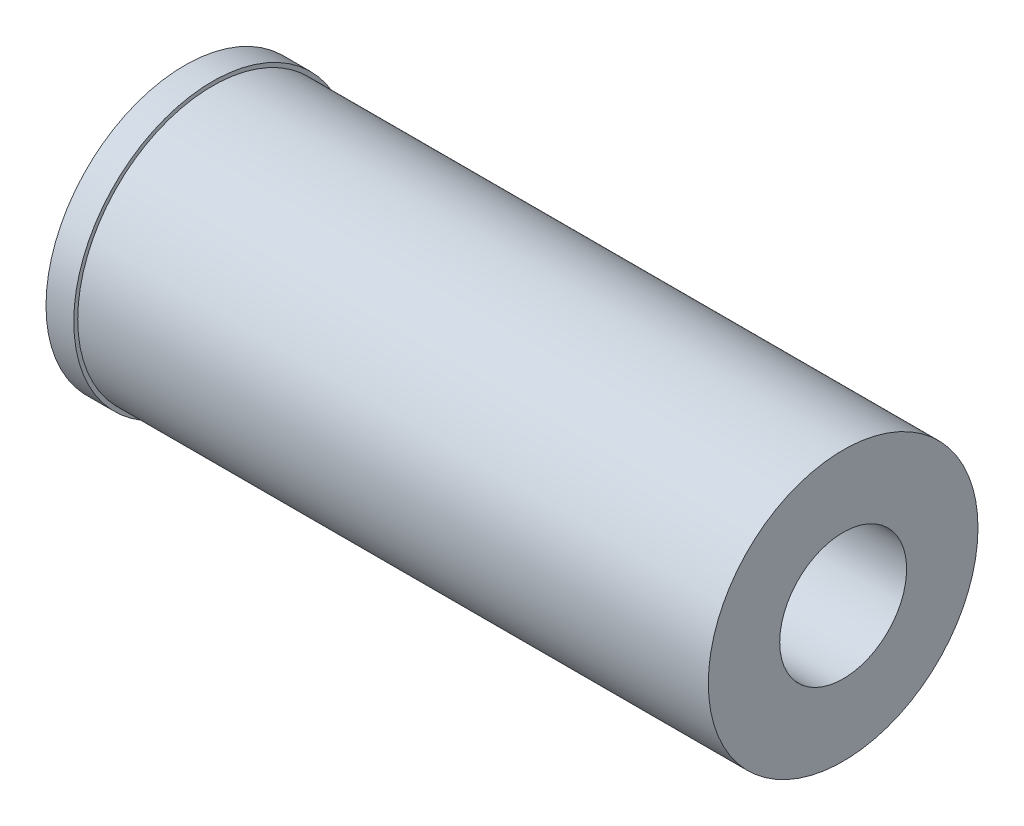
from build123d import *


with BuildPart() as part:
    # Esquisse1 → R_volution1 (revolve)
    with BuildSketch(Plane.XY, mode=Mode.PRIVATE) as r_volution1_sk:
        Polygon((0, 0), (0, 3.5), (0.7, 3.5), (0.7, 3.4), (16.6, 3.4), (16.6, 1.6), (1.5, 1.6), (1.5, 0.8), (0.7, 0.8), (0.7, 0), align=None)
    revolve(r_volution1_sk.sketch.rotate(Axis((0, 0, 0), (1, 0, 0)), 90), axis=Axis((0, 0, 0), (1, 0, 0)))


solid = part.part
